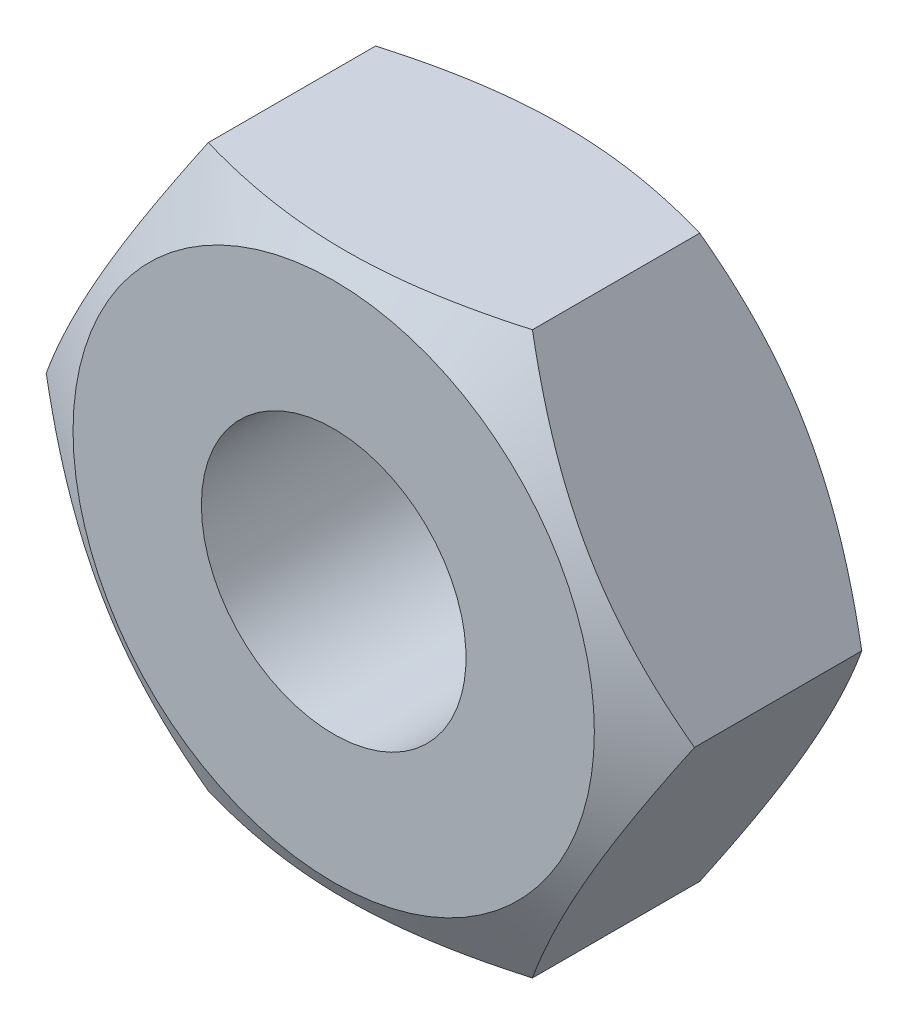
ISO-10303-21;
HEADER;
FILE_DESCRIPTION(('STEP AP214'),'2;1');
FILE_NAME('part.step','',(''),(''),'','','');
FILE_SCHEMA(('AUTOMOTIVE_DESIGN { 1 0 10303 214 1 1 1 1 }'));
ENDSEC;
DATA;
#1=APPLICATION_CONTEXT('core data for automotive mechanical design processes');
#2=APPLICATION_PROTOCOL_DEFINITION('international standard','automotive_design',2000,#1);
#3=PRODUCT_CONTEXT('',#1,'mechanical');
#4=PRODUCT('Part','Part','',(#3));
#5=PRODUCT_RELATED_PRODUCT_CATEGORY('part','',(#4));
#6=PRODUCT_DEFINITION_FORMATION('','',#4);
#7=PRODUCT_DEFINITION_CONTEXT('part definition',#1,'design');
#8=PRODUCT_DEFINITION('design','',#6,#7);
#9=PRODUCT_DEFINITION_SHAPE('','',#8);
#10=(LENGTH_UNIT() NAMED_UNIT(*) SI_UNIT(.MILLI.,.METRE.));
#11=(NAMED_UNIT(*) PLANE_ANGLE_UNIT() SI_UNIT($,.RADIAN.));
#12=(NAMED_UNIT(*) SI_UNIT($,.STERADIAN.) SOLID_ANGLE_UNIT());
#13=UNCERTAINTY_MEASURE_WITH_UNIT(LENGTH_MEASURE(1.E-05),#10,'distance_accuracy_value','');
#14=(GEOMETRIC_REPRESENTATION_CONTEXT(3) GLOBAL_UNCERTAINTY_ASSIGNED_CONTEXT((#13)) GLOBAL_UNIT_ASSIGNED_CONTEXT((#10,
#11,#12)) REPRESENTATION_CONTEXT('',''));
#15=CARTESIAN_POINT('',(0.,0.,0.));
#16=DIRECTION('',(0.,0.,1.));
#17=DIRECTION('',(1.,0.,0.));
#18=AXIS2_PLACEMENT_3D('',#15,#16,#17);
#19=CARTESIAN_POINT('',(0.,-6.99999999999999,3.));
#20=DIRECTION('',(0.,0.,1.));
#21=DIRECTION('',(1.,0.,0.));
#22=AXIS2_PLACEMENT_3D('',#19,#20,#21);
#23=PLANE('',#22);
#24=CARTESIAN_POINT('',(0.,0.,3.));
#25=DIRECTION('',(0.,0.,-1.));
#26=DIRECTION('',(-1.,0.,0.));
#27=AXIS2_PLACEMENT_3D('',#24,#25,#26);
#28=CIRCLE('',#27,3.25);
#29=CARTESIAN_POINT('',(-3.25,0.,3.));
#30=VERTEX_POINT('',#29);
#31=EDGE_CURVE('E93',#30,#30,#28,.T.);
#32=ORIENTED_EDGE('',*,*,#31,.F.);
#33=EDGE_LOOP('',(#32));
#34=FACE_BOUND('',#33,.T.);
#35=CARTESIAN_POINT('',(0.,0.,3.));
#36=DIRECTION('',(0.,0.,-1.));
#37=DIRECTION('',(-1.,0.,0.));
#38=AXIS2_PLACEMENT_3D('',#35,#36,#37);
#39=CIRCLE('',#38,1.65);
#40=CARTESIAN_POINT('',(-1.65,0.,3.));
#41=VERTEX_POINT('',#40);
#42=EDGE_CURVE('E232',#41,#41,#39,.T.);
#43=ORIENTED_EDGE('',*,*,#42,.T.);
#44=EDGE_LOOP('',(#43));
#45=FACE_BOUND('',#44,.T.);
#46=ADVANCED_FACE('F33',(#34,#45),#23,.T.);
#47=CARTESIAN_POINT('',(-2.02072594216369,-3.5,3.));
#48=DIRECTION('',(-0.866025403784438,-0.500000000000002,0.));
#49=DIRECTION('',(0.500000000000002,-0.866025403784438,0.));
#50=AXIS2_PLACEMENT_3D('',#47,#48,#49);
#51=PLANE('',#50);
#52=DIRECTION('',(0.,0.,-1.));
#53=VECTOR('',#52,1.);
#54=CARTESIAN_POINT('',(-2.02072594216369,-3.5,3.));
#55=LINE('',#54,#53);
#56=CARTESIAN_POINT('',(-2.02072594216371,-3.5,2.54305504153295));
#57=VERTEX_POINT('',#56);
#58=CARTESIAN_POINT('',(-2.02072594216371,-3.5,0.45694495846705));
#59=VERTEX_POINT('',#58);
#60=EDGE_CURVE('E11',#57,#59,#55,.T.);
#61=ORIENTED_EDGE('',*,*,#60,.F.);
#62=CARTESIAN_POINT('',(-2.02061047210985,-3.5002,2.54298837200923));
#63=CARTESIAN_POINT('',(-2.10941108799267,-3.34639282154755,2.59427664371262));
#64=CARTESIAN_POINT('',(-2.19897822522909,-3.19125798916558,2.6409214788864));
#65=CARTESIAN_POINT('',(-2.37966345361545,-2.87830199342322,2.72234055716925));
#66=CARTESIAN_POINT('',(-2.47078475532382,-2.72047526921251,2.75708599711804));
#67=CARTESIAN_POINT('',(-2.65189807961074,-2.40677778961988,2.81117240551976));
#68=CARTESIAN_POINT('',(-2.74186223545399,-2.25095530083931,2.83087334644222));
#69=CARTESIAN_POINT('',(-2.92221386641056,-1.93857711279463,2.85439229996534));
#70=CARTESIAN_POINT('',(-3.01260068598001,-1.78202254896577,2.85822978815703));
#71=CARTESIAN_POINT('',(-3.1814939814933,-1.48949078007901,2.85024713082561));
#72=CARTESIAN_POINT('',(-3.26002573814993,-1.3534697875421,2.84038699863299));
#73=CARTESIAN_POINT('',(-3.41657761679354,-1.08231397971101,2.80913596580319));
#74=CARTESIAN_POINT('',(-3.49459719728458,-0.947180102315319,2.7877343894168));
#75=CARTESIAN_POINT('',(-3.65147186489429,-0.675465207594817,2.73423202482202));
#76=CARTESIAN_POINT('',(-3.73030709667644,-0.538918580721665,2.70190443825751));
#77=CARTESIAN_POINT('',(-3.88680174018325,-0.267861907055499,2.6285334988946));
#78=CARTESIAN_POINT('',(-3.9644631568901,-0.133348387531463,2.58750738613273));
#79=CARTESIAN_POINT('',(-4.04156735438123,0.000200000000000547,2.54298837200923));
#80=B_SPLINE_CURVE_WITH_KNOTS('',3,(#62,#63,#64,#65,#66,#67,#68,#69,#70,#71,#72,#73,#74,#75,#76,
#77,#78,#79),.UNSPECIFIED.,.F.,.F.,(4,2,2,2,2,2,2,2,4),(0.,0.554793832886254,1.11092123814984,
1.65328467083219,2.19498204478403,2.6666513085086,3.13875761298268,3.6213361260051,
4.10296698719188),.UNSPECIFIED.);
#81=CARTESIAN_POINT('',(-4.04145188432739,0.,2.54305504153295));
#82=VERTEX_POINT('',#81);
#83=EDGE_CURVE('E89',#57,#82,#80,.T.);
#84=ORIENTED_EDGE('',*,*,#83,.T.);
#85=DIRECTION('',(0.,0.,-1.));
#86=VECTOR('',#85,1.);
#87=CARTESIAN_POINT('',(-4.04145188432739,0.,3.));
#88=LINE('',#87,#86);
#89=CARTESIAN_POINT('',(-4.04145188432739,0.,0.45694495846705));
#90=VERTEX_POINT('',#89);
#91=EDGE_CURVE('E38',#82,#90,#88,.T.);
#92=ORIENTED_EDGE('',*,*,#91,.T.);
#93=CARTESIAN_POINT('',(-4.04156735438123,0.000200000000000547,0.457011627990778));
#94=CARTESIAN_POINT('',(-3.95276673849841,-0.153607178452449,0.405723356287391));
#95=CARTESIAN_POINT('',(-3.86319960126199,-0.308742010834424,0.359078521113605));
#96=CARTESIAN_POINT('',(-3.68251437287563,-0.621698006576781,0.277659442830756));
#97=CARTESIAN_POINT('',(-3.59139307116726,-0.779524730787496,0.242914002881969));
#98=CARTESIAN_POINT('',(-3.41027974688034,-1.09322221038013,0.188827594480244));
#99=CARTESIAN_POINT('',(-3.32031559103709,-1.24904469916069,0.16912665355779));
#100=CARTESIAN_POINT('',(-3.13996396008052,-1.56142288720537,0.145607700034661));
#101=CARTESIAN_POINT('',(-3.04957714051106,-1.71797745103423,0.141770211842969));
#102=CARTESIAN_POINT('',(-2.88068384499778,-2.01050921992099,0.149752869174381));
#103=CARTESIAN_POINT('',(-2.80215208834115,-2.14653021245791,0.159613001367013));
#104=CARTESIAN_POINT('',(-2.64560020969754,-2.417686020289,0.19086403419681));
#105=CARTESIAN_POINT('',(-2.5675806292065,-2.55281989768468,0.212265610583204));
#106=CARTESIAN_POINT('',(-2.41070596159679,-2.82453479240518,0.265767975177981));
#107=CARTESIAN_POINT('',(-2.33187072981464,-2.96108141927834,0.298095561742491));
#108=CARTESIAN_POINT('',(-2.17537608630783,-3.2321380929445,0.371466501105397));
#109=CARTESIAN_POINT('',(-2.09771466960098,-3.36665161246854,0.412492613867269));
#110=CARTESIAN_POINT('',(-2.02061047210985,-3.5002,0.457011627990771));
#111=B_SPLINE_CURVE_WITH_KNOTS('',3,(#93,#94,#95,#96,#97,#98,#99,#100,#101,#102,#103,#104,#105,
#106,#107,#108,#109,#110),.UNSPECIFIED.,.F.,.F.,(4,2,2,2,2,2,2,2,4),(0.,0.554793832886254,
1.11092123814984,1.65328467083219,2.19498204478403,2.6666513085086,3.13875761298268,
3.6213361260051,4.10296698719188),.UNSPECIFIED.);
#112=EDGE_CURVE('E104',#90,#59,#111,.T.);
#113=ORIENTED_EDGE('',*,*,#112,.T.);
#114=EDGE_LOOP('',(#61,#84,#92,#113));
#115=FACE_BOUND('',#114,.T.);
#116=ADVANCED_FACE('F35',(#115),#51,.T.);
#117=CARTESIAN_POINT('',(2.0207259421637,-3.5,3.));
#118=DIRECTION('',(0.,-1.,0.));
#119=DIRECTION('',(0.,0.,-1.));
#120=AXIS2_PLACEMENT_3D('',#117,#118,#119);
#121=PLANE('',#120);
#122=DIRECTION('',(0.,0.,-1.));
#123=VECTOR('',#122,1.);
#124=CARTESIAN_POINT('',(2.0207259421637,-3.5,3.));
#125=LINE('',#124,#123);
#126=CARTESIAN_POINT('',(2.02072594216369,-3.50000000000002,2.54305504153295));
#127=VERTEX_POINT('',#126);
#128=CARTESIAN_POINT('',(2.02072594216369,-3.50000000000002,0.45694495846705));
#129=VERTEX_POINT('',#128);
#130=EDGE_CURVE('E43',#127,#129,#125,.T.);
#131=ORIENTED_EDGE('',*,*,#130,.F.);
#132=CARTESIAN_POINT('',(-5.33926909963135,-3.5,1.19047851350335));
#133=CARTESIAN_POINT('',(-5.18575390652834,-3.5,1.26458226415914));
#134=CARTESIAN_POINT('',(-5.03187348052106,-3.5,1.33794320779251));
#135=CARTESIAN_POINT('',(-4.72318458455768,-3.5,1.48275454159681));
#136=CARTESIAN_POINT('',(-4.56837595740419,-3.5,1.55420459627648));
#137=CARTESIAN_POINT('',(-4.25678688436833,-3.5,1.69514999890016));
#138=CARTESIAN_POINT('',(-4.10000021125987,-3.5,1.76463163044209));
#139=CARTESIAN_POINT('',(-3.78513079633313,-3.5,1.90058153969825));
#140=CARTESIAN_POINT('',(-3.62704812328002,-3.5,1.9670499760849));
#141=CARTESIAN_POINT('',(-3.30746625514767,-3.5,2.09692233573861));
#142=CARTESIAN_POINT('',(-3.14594872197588,-3.5,2.16028138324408));
#143=CARTESIAN_POINT('',(-2.82100146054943,-3.5,2.28198708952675));
#144=CARTESIAN_POINT('',(-2.6575715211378,-3.5,2.34033318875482));
#145=CARTESIAN_POINT('',(-2.32888184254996,-3.5,2.45043062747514));
#146=CARTESIAN_POINT('',(-2.16362690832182,-3.5,2.50219616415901));
#147=CARTESIAN_POINT('',(-1.8307687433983,-3.5,2.59743839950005));
#148=CARTESIAN_POINT('',(-1.66316627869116,-3.5,2.64091773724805));
#149=CARTESIAN_POINT('',(-1.32549061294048,-3.5,2.71746599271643));
#150=CARTESIAN_POINT('',(-1.15541652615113,-3.5,2.75053107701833));
#151=CARTESIAN_POINT('',(-0.813240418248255,-3.5,2.80400754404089));
#152=CARTESIAN_POINT('',(-0.641138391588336,-3.5,2.82441889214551));
#153=CARTESIAN_POINT('',(-0.29688225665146,-3.5,2.8507817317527));
#154=CARTESIAN_POINT('',(-0.124735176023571,-3.5,2.85682266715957));
#155=CARTESIAN_POINT('',(0.21940539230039,-3.5,2.85413261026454));
#156=CARTESIAN_POINT('',(0.39139890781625,-3.5,2.84540535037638));
#157=CARTESIAN_POINT('',(0.68566465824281,-3.5,2.81844985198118));
#158=CARTESIAN_POINT('',(0.808263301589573,-3.5,2.8036002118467));
#159=CARTESIAN_POINT('',(1.05249964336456,-3.5,2.76737314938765));
#160=CARTESIAN_POINT('',(1.17413719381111,-3.5,2.74599474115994));
#161=CARTESIAN_POINT('',(1.53780378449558,-3.5,2.67313142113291));
#162=CARTESIAN_POINT('',(1.77810988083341,-3.5,2.6129676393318));
#163=CARTESIAN_POINT('',(2.1375308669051,-3.5,2.50939822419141));
#164=CARTESIAN_POINT('',(2.25852660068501,-3.5,2.47215447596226));
#165=CARTESIAN_POINT('',(2.4993489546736,-3.5,2.39399495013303));
#166=CARTESIAN_POINT('',(2.61917546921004,-3.5,2.35307884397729));
#167=CARTESIAN_POINT('',(2.8570611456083,-3.5,2.2684483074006));
#168=CARTESIAN_POINT('',(2.97512647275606,-3.5,2.22475103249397));
#169=CARTESIAN_POINT('',(3.21025528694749,-3.5,2.13485264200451));
#170=CARTESIAN_POINT('',(3.32731910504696,-3.5,2.08865239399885));
#171=CARTESIAN_POINT('',(3.44396168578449,-3.5,2.04143557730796));
#172=B_SPLINE_CURVE_WITH_KNOTS('',3,(#132,#133,#134,#135,#136,#137,#138,#139,#140,#141,#142,
#143,#144,#145,#146,#147,#148,#149,#150,#151,#152,#153,#154,#155,#156,#157,#158,#159,#160,#161,
#162,#163,#164,#165,#166,#167,#168,#169,#170,#171),.UNSPECIFIED.,.F.,.F.,(4,2,2,2,2,2,2,2,2,2,2,
2,2,2,2,2,2,2,2,4),(0.,0.511401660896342,1.02289252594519,1.53734553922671,2.05177143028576,
2.5722074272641,3.09270144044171,3.61205273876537,4.13123835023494,4.65061484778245,
5.16999276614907,5.6861294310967,6.20213567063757,6.57243872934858,6.94279773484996,
7.68494754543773,8.06471224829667,8.44451096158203,8.82215928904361,9.19967754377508),.UNSPECIFIED.);
#173=EDGE_CURVE('E97',#127,#57,#172,.F.);
#174=ORIENTED_EDGE('',*,*,#173,.T.);
#175=ORIENTED_EDGE('',*,*,#60,.T.);
#176=CARTESIAN_POINT('',(-5.33926909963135,-3.5,1.80952148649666));
#177=CARTESIAN_POINT('',(-5.18575390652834,-3.5,1.73541773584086));
#178=CARTESIAN_POINT('',(-5.03187348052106,-3.5,1.66205679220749));
#179=CARTESIAN_POINT('',(-4.72318458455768,-3.5,1.51724545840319));
#180=CARTESIAN_POINT('',(-4.56837595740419,-3.5,1.44579540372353));
#181=CARTESIAN_POINT('',(-4.25678688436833,-3.5,1.30485000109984));
#182=CARTESIAN_POINT('',(-4.10000021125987,-3.5,1.23536836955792));
#183=CARTESIAN_POINT('',(-3.78513079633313,-3.5,1.09941846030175));
#184=CARTESIAN_POINT('',(-3.62704812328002,-3.5,1.0329500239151));
#185=CARTESIAN_POINT('',(-3.30746625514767,-3.5,0.903077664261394));
#186=CARTESIAN_POINT('',(-3.14594872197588,-3.5,0.839718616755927));
#187=CARTESIAN_POINT('',(-2.82100146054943,-3.5,0.718012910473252));
#188=CARTESIAN_POINT('',(-2.6575715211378,-3.5,0.659666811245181));
#189=CARTESIAN_POINT('',(-2.32888184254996,-3.5,0.549569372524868));
#190=CARTESIAN_POINT('',(-2.16362690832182,-3.5,0.497803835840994));
#191=CARTESIAN_POINT('',(-1.83076874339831,-3.5,0.402561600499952));
#192=CARTESIAN_POINT('',(-1.66316627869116,-3.5,0.359082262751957));
#193=CARTESIAN_POINT('',(-1.32549061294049,-3.5,0.282534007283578));
#194=CARTESIAN_POINT('',(-1.15541652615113,-3.5,0.249468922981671));
#195=CARTESIAN_POINT('',(-0.813240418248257,-3.5,0.195992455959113));
#196=CARTESIAN_POINT('',(-0.641138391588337,-3.5,0.175581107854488));
#197=CARTESIAN_POINT('',(-0.296882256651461,-3.5,0.149218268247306));
#198=CARTESIAN_POINT('',(-0.124735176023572,-3.5,0.143177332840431));
#199=CARTESIAN_POINT('',(0.21940539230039,-3.5,0.145867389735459));
#200=CARTESIAN_POINT('',(0.39139890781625,-3.5,0.154594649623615));
#201=CARTESIAN_POINT('',(0.685664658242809,-3.5,0.18155014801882));
#202=CARTESIAN_POINT('',(0.808263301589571,-3.5,0.196399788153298));
#203=CARTESIAN_POINT('',(1.05249964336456,-3.5,0.232626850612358));
#204=CARTESIAN_POINT('',(1.17413719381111,-3.5,0.254005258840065));
#205=CARTESIAN_POINT('',(1.53780378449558,-3.5,0.326868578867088));
#206=CARTESIAN_POINT('',(1.77810988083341,-3.5,0.387032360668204));
#207=CARTESIAN_POINT('',(2.1375308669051,-3.5,0.490601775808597));
#208=CARTESIAN_POINT('',(2.25852660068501,-3.5,0.527845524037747));
#209=CARTESIAN_POINT('',(2.4993489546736,-3.5,0.606005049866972));
#210=CARTESIAN_POINT('',(2.61917546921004,-3.5,0.646921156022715));
#211=CARTESIAN_POINT('',(2.8570611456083,-3.5,0.731551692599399));
#212=CARTESIAN_POINT('',(2.97512647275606,-3.5,0.775248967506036));
#213=CARTESIAN_POINT('',(3.21025528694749,-3.5,0.865147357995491));
#214=CARTESIAN_POINT('',(3.32731910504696,-3.5,0.911347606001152));
#215=CARTESIAN_POINT('',(3.44396168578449,-3.5,0.958564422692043));
#216=B_SPLINE_CURVE_WITH_KNOTS('',3,(#176,#177,#178,#179,#180,#181,#182,#183,#184,#185,#186,
#187,#188,#189,#190,#191,#192,#193,#194,#195,#196,#197,#198,#199,#200,#201,#202,#203,#204,#205,
#206,#207,#208,#209,#210,#211,#212,#213,#214,#215),.UNSPECIFIED.,.F.,.F.,(4,2,2,2,2,2,2,2,2,2,2,
2,2,2,2,2,2,2,2,4),(0.,0.511401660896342,1.02289252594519,1.5373455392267,2.05177143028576,
2.5722074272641,3.09270144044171,3.61205273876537,4.13123835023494,4.65061484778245,
5.16999276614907,5.6861294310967,6.20213567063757,6.57243872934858,6.94279773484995,
7.68494754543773,8.06471224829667,8.44451096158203,8.82215928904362,9.19967754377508),.UNSPECIFIED.);
#217=EDGE_CURVE('E106',#59,#129,#216,.T.);
#218=ORIENTED_EDGE('',*,*,#217,.T.);
#219=EDGE_LOOP('',(#131,#174,#175,#218));
#220=FACE_BOUND('',#219,.T.);
#221=ADVANCED_FACE('F162',(#220),#121,.T.);
#222=CARTESIAN_POINT('',(4.04145188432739,0.,3.));
#223=DIRECTION('',(0.866025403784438,-0.500000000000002,0.));
#224=DIRECTION('',(0.500000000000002,0.866025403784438,0.));
#225=AXIS2_PLACEMENT_3D('',#222,#223,#224);
#226=PLANE('',#225);
#227=DIRECTION('',(0.,0.,-1.));
#228=VECTOR('',#227,1.);
#229=CARTESIAN_POINT('',(4.04145188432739,0.,3.));
#230=LINE('',#229,#228);
#231=CARTESIAN_POINT('',(4.04145188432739,0.,2.54305504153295));
#232=VERTEX_POINT('',#231);
#233=CARTESIAN_POINT('',(4.04145188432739,0.,0.45694495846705));
#234=VERTEX_POINT('',#233);
#235=EDGE_CURVE('E198',#232,#234,#230,.T.);
#236=ORIENTED_EDGE('',*,*,#235,.F.);
#237=CARTESIAN_POINT('',(4.04156735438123,0.000200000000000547,2.54298837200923));
#238=CARTESIAN_POINT('',(3.95276673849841,-0.15360717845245,2.59427664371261));
#239=CARTESIAN_POINT('',(3.86319960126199,-0.308742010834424,2.6409214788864));
#240=CARTESIAN_POINT('',(3.68251437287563,-0.621698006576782,2.72234055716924));
#241=CARTESIAN_POINT('',(3.59139307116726,-0.779524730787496,2.75708599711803));
#242=CARTESIAN_POINT('',(3.41027974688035,-1.09322221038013,2.81117240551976));
#243=CARTESIAN_POINT('',(3.32031559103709,-1.24904469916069,2.83087334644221));
#244=CARTESIAN_POINT('',(3.13996396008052,-1.56142288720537,2.85439229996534));
#245=CARTESIAN_POINT('',(3.04957714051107,-1.71797745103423,2.85822978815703));
#246=CARTESIAN_POINT('',(2.88068384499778,-2.01050921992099,2.85024713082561));
#247=CARTESIAN_POINT('',(2.80215208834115,-2.14653021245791,2.84038699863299));
#248=CARTESIAN_POINT('',(2.64560020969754,-2.417686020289,2.80913596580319));
#249=CARTESIAN_POINT('',(2.5675806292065,-2.55281989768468,2.7877343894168));
#250=CARTESIAN_POINT('',(2.41070596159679,-2.82453479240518,2.73423202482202));
#251=CARTESIAN_POINT('',(2.33187072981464,-2.96108141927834,2.70190443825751));
#252=CARTESIAN_POINT('',(2.17537608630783,-3.2321380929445,2.62853349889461));
#253=CARTESIAN_POINT('',(2.09771466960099,-3.36665161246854,2.58750738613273));
#254=CARTESIAN_POINT('',(2.02061047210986,-3.5002,2.54298837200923));
#255=B_SPLINE_CURVE_WITH_KNOTS('',3,(#237,#238,#239,#240,#241,#242,#243,#244,#245,#246,#247,
#248,#249,#250,#251,#252,#253,#254),.UNSPECIFIED.,.F.,.F.,(4,2,2,2,2,2,2,2,4),(0.,
0.554793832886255,1.11092123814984,1.65328467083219,2.19498204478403,2.6666513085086,
3.13875761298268,3.6213361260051,4.10296698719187),.UNSPECIFIED.);
#256=EDGE_CURVE('E168',#232,#127,#255,.T.);
#257=ORIENTED_EDGE('',*,*,#256,.T.);
#258=ORIENTED_EDGE('',*,*,#130,.T.);
#259=CARTESIAN_POINT('',(2.02061047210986,-3.5002,0.457011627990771));
#260=CARTESIAN_POINT('',(2.10941108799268,-3.34639282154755,0.405723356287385));
#261=CARTESIAN_POINT('',(2.1989782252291,-3.19125798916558,0.3590785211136));
#262=CARTESIAN_POINT('',(2.37966345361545,-2.87830199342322,0.277659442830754));
#263=CARTESIAN_POINT('',(2.47078475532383,-2.72047526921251,0.242914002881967));
#264=CARTESIAN_POINT('',(2.65189807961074,-2.40677778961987,0.188827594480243));
#265=CARTESIAN_POINT('',(2.741862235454,-2.25095530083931,0.169126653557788));
#266=CARTESIAN_POINT('',(2.92221386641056,-1.93857711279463,0.145607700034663));
#267=CARTESIAN_POINT('',(3.01260068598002,-1.78202254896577,0.141770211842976));
#268=CARTESIAN_POINT('',(3.18149398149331,-1.48949078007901,0.149752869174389));
#269=CARTESIAN_POINT('',(3.26002573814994,-1.3534697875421,0.159613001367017));
#270=CARTESIAN_POINT('',(3.41657761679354,-1.08231397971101,0.190864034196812));
#271=CARTESIAN_POINT('',(3.49459719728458,-0.947180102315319,0.212265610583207));
#272=CARTESIAN_POINT('',(3.6514718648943,-0.675465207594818,0.265767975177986));
#273=CARTESIAN_POINT('',(3.73030709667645,-0.538918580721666,0.298095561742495));
#274=CARTESIAN_POINT('',(3.88680174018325,-0.2678619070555,0.371466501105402));
#275=CARTESIAN_POINT('',(3.9644631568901,-0.133348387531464,0.412492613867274));
#276=CARTESIAN_POINT('',(4.04156735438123,0.000199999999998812,0.457011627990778));
#277=B_SPLINE_CURVE_WITH_KNOTS('',3,(#259,#260,#261,#262,#263,#264,#265,#266,#267,#268,#269,
#270,#271,#272,#273,#274,#275,#276),.UNSPECIFIED.,.F.,.F.,(4,2,2,2,2,2,2,2,4),(0.,
0.554793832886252,1.11092123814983,1.65328467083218,2.19498204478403,2.6666513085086,
3.13875761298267,3.6213361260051,4.10296698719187),.UNSPECIFIED.);
#278=EDGE_CURVE('E109',#129,#234,#277,.T.);
#279=ORIENTED_EDGE('',*,*,#278,.T.);
#280=EDGE_LOOP('',(#236,#257,#258,#279));
#281=FACE_BOUND('',#280,.T.);
#282=ADVANCED_FACE('F158',(#281),#226,.T.);
#283=CARTESIAN_POINT('',(2.02072594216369,3.5,3.));
#284=DIRECTION('',(0.866025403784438,0.500000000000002,0.));
#285=DIRECTION('',(-0.500000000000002,0.866025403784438,0.));
#286=AXIS2_PLACEMENT_3D('',#283,#284,#285);
#287=PLANE('',#286);
#288=DIRECTION('',(0.,0.,-1.));
#289=VECTOR('',#288,1.);
#290=CARTESIAN_POINT('',(2.02072594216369,3.5,3.));
#291=LINE('',#290,#289);
#292=CARTESIAN_POINT('',(2.02072594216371,3.5,2.54305504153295));
#293=VERTEX_POINT('',#292);
#294=CARTESIAN_POINT('',(2.02072594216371,3.5,0.45694495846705));
#295=VERTEX_POINT('',#294);
#296=EDGE_CURVE('E105',#293,#295,#291,.T.);
#297=ORIENTED_EDGE('',*,*,#296,.F.);
#298=CARTESIAN_POINT('',(2.02061047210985,3.5002,2.54298837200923));
#299=CARTESIAN_POINT('',(2.10941108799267,3.34639282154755,2.59427664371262));
#300=CARTESIAN_POINT('',(2.19897822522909,3.19125798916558,2.6409214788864));
#301=CARTESIAN_POINT('',(2.37966345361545,2.87830199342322,2.72234055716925));
#302=CARTESIAN_POINT('',(2.47078475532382,2.72047526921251,2.75708599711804));
#303=CARTESIAN_POINT('',(2.65189807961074,2.40677778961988,2.81117240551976));
#304=CARTESIAN_POINT('',(2.74186223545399,2.25095530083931,2.83087334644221));
#305=CARTESIAN_POINT('',(2.92221386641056,1.93857711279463,2.85439229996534));
#306=CARTESIAN_POINT('',(3.01260068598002,1.78202254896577,2.85822978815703));
#307=CARTESIAN_POINT('',(3.1814939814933,1.48949078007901,2.85024713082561));
#308=CARTESIAN_POINT('',(3.26002573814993,1.3534697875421,2.84038699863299));
#309=CARTESIAN_POINT('',(3.41657761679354,1.08231397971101,2.80913596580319));
#310=CARTESIAN_POINT('',(3.49459719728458,0.947180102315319,2.7877343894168));
#311=CARTESIAN_POINT('',(3.65147186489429,0.675465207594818,2.73423202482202));
#312=CARTESIAN_POINT('',(3.73030709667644,0.538918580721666,2.70190443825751));
#313=CARTESIAN_POINT('',(3.88680174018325,0.267861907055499,2.6285334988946));
#314=CARTESIAN_POINT('',(3.9644631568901,0.133348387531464,2.58750738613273));
#315=CARTESIAN_POINT('',(4.04156735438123,-0.000200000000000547,2.54298837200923));
#316=B_SPLINE_CURVE_WITH_KNOTS('',3,(#298,#299,#300,#301,#302,#303,#304,#305,#306,#307,#308,
#309,#310,#311,#312,#313,#314,#315),.UNSPECIFIED.,.F.,.F.,(4,2,2,2,2,2,2,2,4),(0.,
0.554793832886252,1.11092123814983,1.65328467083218,2.19498204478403,2.6666513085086,
3.13875761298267,3.6213361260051,4.10296698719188),.UNSPECIFIED.);
#317=EDGE_CURVE('E175',#293,#232,#316,.T.);
#318=ORIENTED_EDGE('',*,*,#317,.T.);
#319=ORIENTED_EDGE('',*,*,#235,.T.);
#320=CARTESIAN_POINT('',(4.04156735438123,-0.000200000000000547,0.457011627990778));
#321=CARTESIAN_POINT('',(3.95276673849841,0.153607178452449,0.405723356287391));
#322=CARTESIAN_POINT('',(3.86319960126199,0.308742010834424,0.359078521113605));
#323=CARTESIAN_POINT('',(3.68251437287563,0.621698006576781,0.277659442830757));
#324=CARTESIAN_POINT('',(3.59139307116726,0.779524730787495,0.242914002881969));
#325=CARTESIAN_POINT('',(3.41027974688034,1.09322221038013,0.188827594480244));
#326=CARTESIAN_POINT('',(3.32031559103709,1.24904469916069,0.169126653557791));
#327=CARTESIAN_POINT('',(3.13996396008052,1.56142288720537,0.145607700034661));
#328=CARTESIAN_POINT('',(3.04957714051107,1.71797745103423,0.141770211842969));
#329=CARTESIAN_POINT('',(2.88068384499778,2.01050921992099,0.149752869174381));
#330=CARTESIAN_POINT('',(2.80215208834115,2.14653021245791,0.159613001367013));
#331=CARTESIAN_POINT('',(2.64560020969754,2.41768602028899,0.19086403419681));
#332=CARTESIAN_POINT('',(2.5675806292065,2.55281989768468,0.212265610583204));
#333=CARTESIAN_POINT('',(2.41070596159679,2.82453479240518,0.265767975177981));
#334=CARTESIAN_POINT('',(2.33187072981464,2.96108141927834,0.298095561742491));
#335=CARTESIAN_POINT('',(2.17537608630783,3.2321380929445,0.371466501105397));
#336=CARTESIAN_POINT('',(2.09771466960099,3.36665161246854,0.412492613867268));
#337=CARTESIAN_POINT('',(2.02061047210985,3.5002,0.457011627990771));
#338=B_SPLINE_CURVE_WITH_KNOTS('',3,(#320,#321,#322,#323,#324,#325,#326,#327,#328,#329,#330,
#331,#332,#333,#334,#335,#336,#337),.UNSPECIFIED.,.F.,.F.,(4,2,2,2,2,2,2,2,4),(0.,
0.554793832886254,1.11092123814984,1.65328467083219,2.19498204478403,2.6666513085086,
3.13875761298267,3.6213361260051,4.10296698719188),.UNSPECIFIED.);
#339=EDGE_CURVE('E148',#234,#295,#338,.T.);
#340=ORIENTED_EDGE('',*,*,#339,.T.);
#341=EDGE_LOOP('',(#297,#318,#319,#340));
#342=FACE_BOUND('',#341,.T.);
#343=ADVANCED_FACE('F161',(#342),#287,.T.);
#344=CARTESIAN_POINT('',(-2.02072594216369,3.5,3.));
#345=DIRECTION('',(0.,1.,0.));
#346=DIRECTION('',(-1.,0.,0.));
#347=AXIS2_PLACEMENT_3D('',#344,#345,#346);
#348=PLANE('',#347);
#349=DIRECTION('',(0.,0.,-1.));
#350=VECTOR('',#349,1.);
#351=CARTESIAN_POINT('',(-2.02072594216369,3.5,3.));
#352=LINE('',#351,#350);
#353=CARTESIAN_POINT('',(-2.02072594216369,3.5,2.54305504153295));
#354=VERTEX_POINT('',#353);
#355=CARTESIAN_POINT('',(-2.02072594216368,3.50000000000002,0.45694495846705));
#356=VERTEX_POINT('',#355);
#357=EDGE_CURVE('E103',#354,#356,#352,.T.);
#358=ORIENTED_EDGE('',*,*,#357,.F.);
#359=CARTESIAN_POINT('',(-5.33926909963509,3.5,1.19047851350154));
#360=CARTESIAN_POINT('',(-5.18575390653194,3.5,1.26458226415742));
#361=CARTESIAN_POINT('',(-5.03187348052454,3.5,1.33794320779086));
#362=CARTESIAN_POINT('',(-4.7231845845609,3.5,1.48275454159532));
#363=CARTESIAN_POINT('',(-4.56837595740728,3.5,1.55420459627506));
#364=CARTESIAN_POINT('',(-4.25678688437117,3.5,1.6951499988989));
#365=CARTESIAN_POINT('',(-4.10000021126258,3.5,1.7646316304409));
#366=CARTESIAN_POINT('',(-3.78513079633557,3.5,1.90058153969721));
#367=CARTESIAN_POINT('',(-3.62704812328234,3.5,1.96704997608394));
#368=CARTESIAN_POINT('',(-3.30746625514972,3.5,2.0969223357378));
#369=CARTESIAN_POINT('',(-3.14594872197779,3.5,2.16028138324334));
#370=CARTESIAN_POINT('',(-2.82100146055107,3.5,2.28198708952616));
#371=CARTESIAN_POINT('',(-2.6575715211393,3.5,2.3403331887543));
#372=CARTESIAN_POINT('',(-2.32888184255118,3.5,2.45043062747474));
#373=CARTESIAN_POINT('',(-2.16362690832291,3.5,2.50219616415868));
#374=CARTESIAN_POINT('',(-1.83076874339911,3.5,2.59743839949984));
#375=CARTESIAN_POINT('',(-1.66316627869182,3.5,2.64091773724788));
#376=CARTESIAN_POINT('',(-1.32549061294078,3.5,2.71746599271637));
#377=CARTESIAN_POINT('',(-1.1554165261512,3.5,2.75053107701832));
#378=CARTESIAN_POINT('',(-0.813240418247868,3.5,2.80400754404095));
#379=CARTESIAN_POINT('',(-0.641138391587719,3.5,2.82441889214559));
#380=CARTESIAN_POINT('',(-0.296882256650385,3.5,2.85078173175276));
#381=CARTESIAN_POINT('',(-0.124735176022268,3.5,2.8568226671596));
#382=CARTESIAN_POINT('',(0.219405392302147,3.5,2.85413261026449));
#383=CARTESIAN_POINT('',(0.391398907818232,3.5,2.84540535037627));
#384=CARTESIAN_POINT('',(0.685664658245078,3.5,2.81844985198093));
#385=CARTESIAN_POINT('',(0.808263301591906,3.5,2.8036002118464));
#386=CARTESIAN_POINT('',(1.05249964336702,3.5,2.76737314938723));
#387=CARTESIAN_POINT('',(1.17413719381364,3.5,2.74599474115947));
#388=CARTESIAN_POINT('',(1.53780378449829,3.5,2.67313142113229));
#389=CARTESIAN_POINT('',(1.77810988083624,3.5,2.61296763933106));
#390=CARTESIAN_POINT('',(2.13753086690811,3.5,2.5093982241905));
#391=CARTESIAN_POINT('',(2.25852660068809,3.5,2.47215447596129));
#392=CARTESIAN_POINT('',(2.4993489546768,3.5,2.39399495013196));
#393=CARTESIAN_POINT('',(2.61917546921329,3.5,2.35307884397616));
#394=CARTESIAN_POINT('',(2.85706114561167,3.5,2.26844830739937));
#395=CARTESIAN_POINT('',(2.97512647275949,3.5,2.22475103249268));
#396=CARTESIAN_POINT('',(3.21025528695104,3.5,2.13485264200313));
#397=CARTESIAN_POINT('',(3.32731910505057,3.5,2.08865239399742));
#398=CARTESIAN_POINT('',(3.44396168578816,3.5,2.04143557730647));
#399=B_SPLINE_CURVE_WITH_KNOTS('',3,(#359,#360,#361,#362,#363,#364,#365,#366,#367,#368,#369,
#370,#371,#372,#373,#374,#375,#376,#377,#378,#379,#380,#381,#382,#383,#384,#385,#386,#387,#388,
#389,#390,#391,#392,#393,#394,#395,#396,#397,#398),.UNSPECIFIED.,.F.,.F.,(4,2,2,2,2,2,2,2,2,2,2,
2,2,2,2,2,2,2,2,4),(0.,0.511401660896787,1.02289252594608,1.53734553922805,2.05177143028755,
2.57220742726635,3.09270144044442,3.61205273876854,4.13123835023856,4.65061484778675,
5.16999276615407,5.68612943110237,6.20213567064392,6.57243872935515,6.94279773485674,
7.68494754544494,8.06471224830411,8.4445109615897,8.8221592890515,9.19967754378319),.UNSPECIFIED.);
#400=EDGE_CURVE('E51',#354,#293,#399,.T.);
#401=ORIENTED_EDGE('',*,*,#400,.T.);
#402=ORIENTED_EDGE('',*,*,#296,.T.);
#403=CARTESIAN_POINT('',(-5.33926909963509,3.5,1.80952148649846));
#404=CARTESIAN_POINT('',(-5.18575390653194,3.5,1.73541773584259));
#405=CARTESIAN_POINT('',(-5.03187348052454,3.5,1.66205679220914));
#406=CARTESIAN_POINT('',(-4.7231845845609,3.5,1.51724545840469));
#407=CARTESIAN_POINT('',(-4.56837595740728,3.5,1.44579540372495));
#408=CARTESIAN_POINT('',(-4.25678688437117,3.5,1.30485000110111));
#409=CARTESIAN_POINT('',(-4.10000021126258,3.5,1.23536836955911));
#410=CARTESIAN_POINT('',(-3.78513079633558,3.5,1.09941846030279));
#411=CARTESIAN_POINT('',(-3.62704812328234,3.5,1.03295002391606));
#412=CARTESIAN_POINT('',(-3.30746625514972,3.5,0.903077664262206));
#413=CARTESIAN_POINT('',(-3.14594872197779,3.5,0.839718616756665));
#414=CARTESIAN_POINT('',(-2.82100146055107,3.5,0.718012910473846));
#415=CARTESIAN_POINT('',(-2.6575715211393,3.5,0.659666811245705));
#416=CARTESIAN_POINT('',(-2.32888184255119,3.5,0.549569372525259));
#417=CARTESIAN_POINT('',(-2.16362690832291,3.5,0.497803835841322));
#418=CARTESIAN_POINT('',(-1.83076874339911,3.5,0.402561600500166));
#419=CARTESIAN_POINT('',(-1.66316627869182,3.5,0.359082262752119));
#420=CARTESIAN_POINT('',(-1.32549061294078,3.5,0.282534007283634));
#421=CARTESIAN_POINT('',(-1.1554165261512,3.5,0.249468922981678));
#422=CARTESIAN_POINT('',(-0.813240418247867,3.5,0.195992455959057));
#423=CARTESIAN_POINT('',(-0.641138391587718,3.5,0.175581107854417));
#424=CARTESIAN_POINT('',(-0.296882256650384,3.5,0.149218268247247));
#425=CARTESIAN_POINT('',(-0.124735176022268,3.5,0.143177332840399));
#426=CARTESIAN_POINT('',(0.219405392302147,3.5,0.145867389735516));
#427=CARTESIAN_POINT('',(0.391398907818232,3.5,0.154594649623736));
#428=CARTESIAN_POINT('',(0.685664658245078,3.5,0.18155014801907));
#429=CARTESIAN_POINT('',(0.808263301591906,3.5,0.196399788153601));
#430=CARTESIAN_POINT('',(1.05249964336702,3.5,0.232626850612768));
#431=CARTESIAN_POINT('',(1.17413719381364,3.5,0.254005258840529));
#432=CARTESIAN_POINT('',(1.53780378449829,3.5,0.326868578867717));
#433=CARTESIAN_POINT('',(1.77810988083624,3.5,0.387032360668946));
#434=CARTESIAN_POINT('',(2.13753086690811,3.5,0.490601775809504));
#435=CARTESIAN_POINT('',(2.25852660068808,3.5,0.527845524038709));
#436=CARTESIAN_POINT('',(2.4993489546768,3.5,0.606005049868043));
#437=CARTESIAN_POINT('',(2.61917546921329,3.5,0.646921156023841));
#438=CARTESIAN_POINT('',(2.85706114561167,3.5,0.73155169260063));
#439=CARTESIAN_POINT('',(2.97512647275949,3.5,0.775248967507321));
#440=CARTESIAN_POINT('',(3.21025528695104,3.5,0.865147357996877));
#441=CARTESIAN_POINT('',(3.32731910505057,3.5,0.911347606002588));
#442=CARTESIAN_POINT('',(3.44396168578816,3.5,0.958564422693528));
#443=B_SPLINE_CURVE_WITH_KNOTS('',3,(#403,#404,#405,#406,#407,#408,#409,#410,#411,#412,#413,
#414,#415,#416,#417,#418,#419,#420,#421,#422,#423,#424,#425,#426,#427,#428,#429,#430,#431,#432,
#433,#434,#435,#436,#437,#438,#439,#440,#441,#442),.UNSPECIFIED.,.F.,.F.,(4,2,2,2,2,2,2,2,2,2,2,
2,2,2,2,2,2,2,2,4),(0.,0.511401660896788,1.02289252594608,1.53734553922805,2.05177143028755,
2.57220742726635,3.09270144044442,3.61205273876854,4.13123835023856,4.65061484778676,
5.16999276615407,5.68612943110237,6.20213567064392,6.57243872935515,6.94279773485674,
7.68494754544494,8.06471224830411,8.4445109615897,8.8221592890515,9.19967754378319),.UNSPECIFIED.);
#444=EDGE_CURVE('E141',#295,#356,#443,.F.);
#445=ORIENTED_EDGE('',*,*,#444,.T.);
#446=EDGE_LOOP('',(#358,#401,#402,#445));
#447=FACE_BOUND('',#446,.T.);
#448=ADVANCED_FACE('F206',(#447),#348,.T.);
#449=CARTESIAN_POINT('',(-4.04145188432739,0.,3.));
#450=DIRECTION('',(-0.866025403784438,0.500000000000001,0.));
#451=DIRECTION('',(-0.500000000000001,-0.866025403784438,0.));
#452=AXIS2_PLACEMENT_3D('',#449,#450,#451);
#453=PLANE('',#452);
#454=ORIENTED_EDGE('',*,*,#91,.F.);
#455=CARTESIAN_POINT('',(-4.04156735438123,-0.000200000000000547,2.54298837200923));
#456=CARTESIAN_POINT('',(-3.95276673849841,0.153607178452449,2.59427664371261));
#457=CARTESIAN_POINT('',(-3.86319960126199,0.308742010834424,2.6409214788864));
#458=CARTESIAN_POINT('',(-3.68251437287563,0.621698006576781,2.72234055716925));
#459=CARTESIAN_POINT('',(-3.59139307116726,0.779524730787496,2.75708599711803));
#460=CARTESIAN_POINT('',(-3.41027974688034,1.09322221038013,2.81117240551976));
#461=CARTESIAN_POINT('',(-3.32031559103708,1.24904469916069,2.83087334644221));
#462=CARTESIAN_POINT('',(-3.13996396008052,1.56142288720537,2.85439229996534));
#463=CARTESIAN_POINT('',(-3.04957714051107,1.71797745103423,2.85822978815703));
#464=CARTESIAN_POINT('',(-2.88068384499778,2.01050921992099,2.85024713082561));
#465=CARTESIAN_POINT('',(-2.80215208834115,2.14653021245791,2.84038699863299));
#466=CARTESIAN_POINT('',(-2.64560020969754,2.417686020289,2.80913596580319));
#467=CARTESIAN_POINT('',(-2.5675806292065,2.55281989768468,2.7877343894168));
#468=CARTESIAN_POINT('',(-2.41070596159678,2.82453479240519,2.73423202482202));
#469=CARTESIAN_POINT('',(-2.33187072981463,2.96108141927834,2.70190443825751));
#470=CARTESIAN_POINT('',(-2.17537608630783,3.2321380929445,2.62853349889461));
#471=CARTESIAN_POINT('',(-2.09771466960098,3.36665161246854,2.58750738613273));
#472=CARTESIAN_POINT('',(-2.02061047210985,3.5002,2.54298837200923));
#473=B_SPLINE_CURVE_WITH_KNOTS('',3,(#455,#456,#457,#458,#459,#460,#461,#462,#463,#464,#465,
#466,#467,#468,#469,#470,#471,#472),.UNSPECIFIED.,.F.,.F.,(4,2,2,2,2,2,2,2,4),(0.,
0.554793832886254,1.11092123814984,1.65328467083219,2.19498204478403,2.6666513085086,
3.13875761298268,3.6213361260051,4.10296698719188),.UNSPECIFIED.);
#474=EDGE_CURVE('E86',#82,#354,#473,.T.);
#475=ORIENTED_EDGE('',*,*,#474,.T.);
#476=ORIENTED_EDGE('',*,*,#357,.T.);
#477=CARTESIAN_POINT('',(-2.02061047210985,3.5002,0.457011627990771));
#478=CARTESIAN_POINT('',(-2.10941108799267,3.34639282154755,0.405723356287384));
#479=CARTESIAN_POINT('',(-2.19897822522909,3.19125798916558,0.359078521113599));
#480=CARTESIAN_POINT('',(-2.37966345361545,2.87830199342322,0.277659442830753));
#481=CARTESIAN_POINT('',(-2.47078475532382,2.72047526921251,0.242914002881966));
#482=CARTESIAN_POINT('',(-2.65189807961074,2.40677778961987,0.188827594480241));
#483=CARTESIAN_POINT('',(-2.74186223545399,2.25095530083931,0.169126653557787));
#484=CARTESIAN_POINT('',(-2.92221386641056,1.93857711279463,0.145607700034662));
#485=CARTESIAN_POINT('',(-3.01260068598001,1.78202254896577,0.141770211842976));
#486=CARTESIAN_POINT('',(-3.1814939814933,1.48949078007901,0.149752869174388));
#487=CARTESIAN_POINT('',(-3.26002573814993,1.3534697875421,0.159613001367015));
#488=CARTESIAN_POINT('',(-3.41657761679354,1.08231397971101,0.19086403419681));
#489=CARTESIAN_POINT('',(-3.49459719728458,0.947180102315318,0.212265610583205));
#490=CARTESIAN_POINT('',(-3.65147186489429,0.675465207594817,0.265767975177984));
#491=CARTESIAN_POINT('',(-3.73030709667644,0.538918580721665,0.298095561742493));
#492=CARTESIAN_POINT('',(-3.88680174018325,0.267861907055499,0.3714665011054));
#493=CARTESIAN_POINT('',(-3.96446315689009,0.133348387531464,0.412492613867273));
#494=CARTESIAN_POINT('',(-4.04156735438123,-0.000200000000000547,0.457011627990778));
#495=B_SPLINE_CURVE_WITH_KNOTS('',3,(#477,#478,#479,#480,#481,#482,#483,#484,#485,#486,#487,
#488,#489,#490,#491,#492,#493,#494),.UNSPECIFIED.,.F.,.F.,(4,2,2,2,2,2,2,2,4),(0.,
0.554793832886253,1.11092123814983,1.65328467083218,2.19498204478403,2.6666513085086,
3.13875761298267,3.6213361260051,4.10296698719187),.UNSPECIFIED.);
#496=EDGE_CURVE('E102',#356,#90,#495,.T.);
#497=ORIENTED_EDGE('',*,*,#496,.T.);
#498=EDGE_LOOP('',(#454,#475,#476,#497));
#499=FACE_BOUND('',#498,.T.);
#500=ADVANCED_FACE('F100',(#499),#453,.T.);
#501=CARTESIAN_POINT('',(0.,0.,0.));
#502=DIRECTION('',(0.,0.,1.));
#503=DIRECTION('',(1.,0.,0.));
#504=AXIS2_PLACEMENT_3D('',#501,#502,#503);
#505=CONICAL_SURFACE('',#504,3.25,1.0471975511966);
#506=ORIENTED_EDGE('',*,*,#496,.F.);
#507=ORIENTED_EDGE('',*,*,#444,.F.);
#508=ORIENTED_EDGE('',*,*,#339,.F.);
#509=ORIENTED_EDGE('',*,*,#278,.F.);
#510=ORIENTED_EDGE('',*,*,#217,.F.);
#511=ORIENTED_EDGE('',*,*,#112,.F.);
#512=EDGE_LOOP('',(#506,#507,#508,#509,#510,#511));
#513=FACE_BOUND('',#512,.T.);
#514=CARTESIAN_POINT('',(0.,0.,0.));
#515=DIRECTION('',(0.,0.,-1.));
#516=DIRECTION('',(-1.,0.,0.));
#517=AXIS2_PLACEMENT_3D('',#514,#515,#516);
#518=CIRCLE('',#517,3.25);
#519=CARTESIAN_POINT('',(-3.25,0.,0.));
#520=VERTEX_POINT('',#519);
#521=EDGE_CURVE('E96',#520,#520,#518,.T.);
#522=ORIENTED_EDGE('',*,*,#521,.F.);
#523=EDGE_LOOP('',(#522));
#524=FACE_BOUND('',#523,.T.);
#525=ADVANCED_FACE('F121',(#513,#524),#505,.T.);
#526=CARTESIAN_POINT('',(0.,-6.99999999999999,0.));
#527=DIRECTION('',(0.,0.,1.));
#528=DIRECTION('',(1.,0.,0.));
#529=AXIS2_PLACEMENT_3D('',#526,#527,#528);
#530=PLANE('',#529);
#531=CARTESIAN_POINT('',(0.,0.,0.));
#532=DIRECTION('',(0.,0.,-1.));
#533=DIRECTION('',(-1.,0.,0.));
#534=AXIS2_PLACEMENT_3D('',#531,#532,#533);
#535=CIRCLE('',#534,1.65);
#536=CARTESIAN_POINT('',(-1.65,0.,0.));
#537=VERTEX_POINT('',#536);
#538=EDGE_CURVE('E234',#537,#537,#535,.T.);
#539=ORIENTED_EDGE('',*,*,#538,.F.);
#540=EDGE_LOOP('',(#539));
#541=FACE_BOUND('',#540,.T.);
#542=ORIENTED_EDGE('',*,*,#521,.T.);
#543=EDGE_LOOP('',(#542));
#544=FACE_BOUND('',#543,.T.);
#545=ADVANCED_FACE('F126',(#541,#544),#530,.F.);
#546=CARTESIAN_POINT('',(0.,0.,3.));
#547=DIRECTION('',(0.,0.,-1.));
#548=DIRECTION('',(1.,0.,0.));
#549=AXIS2_PLACEMENT_3D('',#546,#547,#548);
#550=CONICAL_SURFACE('',#549,3.25,1.0471975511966);
#551=ORIENTED_EDGE('',*,*,#173,.F.);
#552=ORIENTED_EDGE('',*,*,#256,.F.);
#553=ORIENTED_EDGE('',*,*,#317,.F.);
#554=ORIENTED_EDGE('',*,*,#400,.F.);
#555=ORIENTED_EDGE('',*,*,#474,.F.);
#556=ORIENTED_EDGE('',*,*,#83,.F.);
#557=EDGE_LOOP('',(#551,#552,#553,#554,#555,#556));
#558=FACE_BOUND('',#557,.T.);
#559=ORIENTED_EDGE('',*,*,#31,.T.);
#560=EDGE_LOOP('',(#559));
#561=FACE_BOUND('',#560,.T.);
#562=ADVANCED_FACE('F87',(#558,#561),#550,.T.);
#563=CARTESIAN_POINT('',(0.,0.,0.));
#564=DIRECTION('',(0.,0.,-1.));
#565=DIRECTION('',(-1.,0.,0.));
#566=AXIS2_PLACEMENT_3D('',#563,#564,#565);
#567=CYLINDRICAL_SURFACE('',#566,1.65);
#568=ORIENTED_EDGE('',*,*,#42,.F.);
#569=EDGE_LOOP('',(#568));
#570=FACE_BOUND('',#569,.T.);
#571=ORIENTED_EDGE('',*,*,#538,.T.);
#572=EDGE_LOOP('',(#571));
#573=FACE_BOUND('',#572,.T.);
#574=ADVANCED_FACE('F239',(#570,#573),#567,.F.);
#575=CLOSED_SHELL('',(#46,#116,#221,#282,#343,#448,#500,#525,#545,#562,#574));
#576=MANIFOLD_SOLID_BREP('B2',#575);
#577=ADVANCED_BREP_SHAPE_REPRESENTATION('',(#18,#576),#14);
#578=SHAPE_DEFINITION_REPRESENTATION(#9,#577);
ENDSEC;
END-ISO-10303-21;
